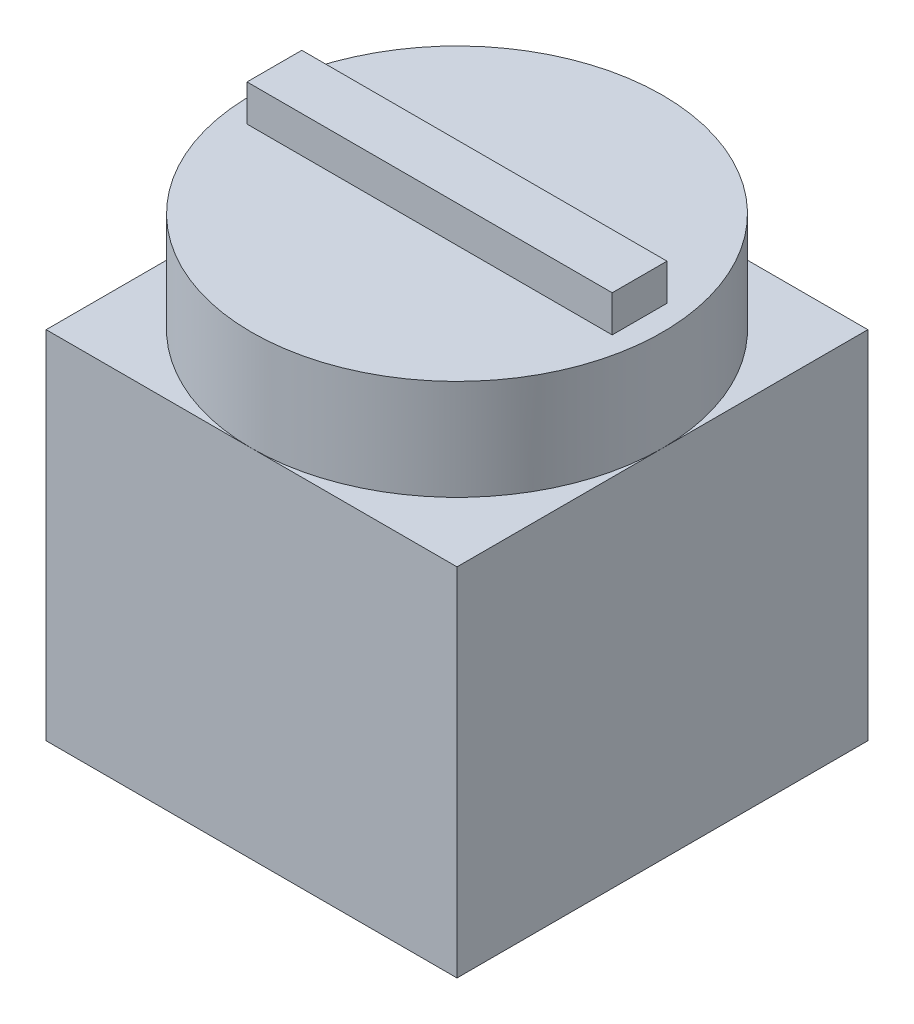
ISO-10303-21;
HEADER;
FILE_DESCRIPTION(('STEP AP214'),'2;1');
FILE_NAME('part.step','',(''),(''),'','','');
FILE_SCHEMA(('AUTOMOTIVE_DESIGN { 1 0 10303 214 1 1 1 1 }'));
ENDSEC;
DATA;
#1=APPLICATION_CONTEXT('core data for automotive mechanical design processes');
#2=APPLICATION_PROTOCOL_DEFINITION('international standard','automotive_design',2000,#1);
#3=PRODUCT_CONTEXT('',#1,'mechanical');
#4=PRODUCT('Part','Part','',(#3));
#5=PRODUCT_RELATED_PRODUCT_CATEGORY('part','',(#4));
#6=PRODUCT_DEFINITION_FORMATION('','',#4);
#7=PRODUCT_DEFINITION_CONTEXT('part definition',#1,'design');
#8=PRODUCT_DEFINITION('design','',#6,#7);
#9=PRODUCT_DEFINITION_SHAPE('','',#8);
#10=(LENGTH_UNIT() NAMED_UNIT(*) SI_UNIT(.MILLI.,.METRE.));
#11=(NAMED_UNIT(*) PLANE_ANGLE_UNIT() SI_UNIT($,.RADIAN.));
#12=(NAMED_UNIT(*) SI_UNIT($,.STERADIAN.) SOLID_ANGLE_UNIT());
#13=UNCERTAINTY_MEASURE_WITH_UNIT(LENGTH_MEASURE(1.E-05),#10,'distance_accuracy_value','');
#14=(GEOMETRIC_REPRESENTATION_CONTEXT(3) GLOBAL_UNCERTAINTY_ASSIGNED_CONTEXT((#13)) GLOBAL_UNIT_ASSIGNED_CONTEXT((#10,
#11,#12)) REPRESENTATION_CONTEXT('',''));
#15=CARTESIAN_POINT('',(0.,0.,0.));
#16=DIRECTION('',(0.,0.,1.));
#17=DIRECTION('',(1.,0.,0.));
#18=AXIS2_PLACEMENT_3D('',#15,#16,#17);
#19=CARTESIAN_POINT('',(0.,7.8,0.));
#20=DIRECTION('',(0.,1.,0.));
#21=DIRECTION('',(0.,0.,1.));
#22=AXIS2_PLACEMENT_3D('',#19,#20,#21);
#23=PLANE('',#22);
#24=CARTESIAN_POINT('',(0.,7.8,0.));
#25=DIRECTION('',(0.,1.,0.));
#26=DIRECTION('',(0.,0.,1.));
#27=AXIS2_PLACEMENT_3D('',#24,#25,#26);
#28=CIRCLE('',#27,4.5);
#29=CARTESIAN_POINT('',(0.,7.8,4.5));
#30=VERTEX_POINT('',#29);
#31=CARTESIAN_POINT('',(4.5,7.8,0.));
#32=VERTEX_POINT('',#31);
#33=EDGE_CURVE('E48',#30,#32,#28,.T.);
#34=ORIENTED_EDGE('',*,*,#33,.F.);
#35=DIRECTION('',(1.,0.,0.));
#36=VECTOR('',#35,1.);
#37=CARTESIAN_POINT('',(-4.5,7.8,4.5));
#38=LINE('',#37,#36);
#39=CARTESIAN_POINT('',(4.5,7.8,4.5));
#40=VERTEX_POINT('',#39);
#41=EDGE_CURVE('E161',#30,#40,#38,.T.);
#42=ORIENTED_EDGE('',*,*,#41,.T.);
#43=DIRECTION('',(0.,0.,-1.));
#44=VECTOR('',#43,1.);
#45=CARTESIAN_POINT('',(4.5,7.8,-4.5));
#46=LINE('',#45,#44);
#47=EDGE_CURVE('E149',#40,#32,#46,.T.);
#48=ORIENTED_EDGE('',*,*,#47,.T.);
#49=EDGE_LOOP('',(#34,#42,#48));
#50=FACE_BOUND('',#49,.T.);
#51=ADVANCED_FACE('F37',(#50),#23,.T.);
#52=CARTESIAN_POINT('',(0.,7.8,-4.5));
#53=VERTEX_POINT('',#52);
#54=EDGE_CURVE('E11',#32,#53,#28,.T.);
#55=ORIENTED_EDGE('',*,*,#54,.F.);
#56=CARTESIAN_POINT('',(4.5,7.8,-4.5));
#57=VERTEX_POINT('',#56);
#58=EDGE_CURVE('E153',#32,#57,#46,.T.);
#59=ORIENTED_EDGE('',*,*,#58,.T.);
#60=DIRECTION('',(-1.,0.,0.));
#61=VECTOR('',#60,1.);
#62=CARTESIAN_POINT('',(-4.5,7.8,-4.5));
#63=LINE('',#62,#61);
#64=EDGE_CURVE('E154',#57,#53,#63,.T.);
#65=ORIENTED_EDGE('',*,*,#64,.T.);
#66=EDGE_LOOP('',(#55,#59,#65));
#67=FACE_BOUND('',#66,.T.);
#68=ADVANCED_FACE('F196',(#67),#23,.T.);
#69=CARTESIAN_POINT('',(-4.5,7.8,0.));
#70=VERTEX_POINT('',#69);
#71=EDGE_CURVE('E46',#53,#70,#28,.T.);
#72=ORIENTED_EDGE('',*,*,#71,.F.);
#73=CARTESIAN_POINT('',(-4.5,7.8,-4.5));
#74=VERTEX_POINT('',#73);
#75=EDGE_CURVE('E152',#53,#74,#63,.T.);
#76=ORIENTED_EDGE('',*,*,#75,.T.);
#77=DIRECTION('',(0.,0.,1.));
#78=VECTOR('',#77,1.);
#79=CARTESIAN_POINT('',(-4.5,7.8,-4.5));
#80=LINE('',#79,#78);
#81=EDGE_CURVE('E158',#74,#70,#80,.T.);
#82=ORIENTED_EDGE('',*,*,#81,.T.);
#83=EDGE_LOOP('',(#72,#76,#82));
#84=FACE_BOUND('',#83,.T.);
#85=ADVANCED_FACE('F193',(#84),#23,.T.);
#86=CARTESIAN_POINT('',(4.5,7.8,-4.5));
#87=DIRECTION('',(-1.,0.,0.));
#88=DIRECTION('',(0.,0.,1.));
#89=AXIS2_PLACEMENT_3D('',#86,#87,#88);
#90=PLANE('',#89);
#91=DIRECTION('',(0.,0.,-1.));
#92=VECTOR('',#91,1.);
#93=CARTESIAN_POINT('',(4.5,0.,-4.5));
#94=LINE('',#93,#92);
#95=CARTESIAN_POINT('',(4.5,0.,4.5));
#96=VERTEX_POINT('',#95);
#97=CARTESIAN_POINT('',(4.5,0.,-4.5));
#98=VERTEX_POINT('',#97);
#99=EDGE_CURVE('E147',#96,#98,#94,.T.);
#100=ORIENTED_EDGE('',*,*,#99,.T.);
#101=DIRECTION('',(0.,-1.,0.));
#102=VECTOR('',#101,1.);
#103=CARTESIAN_POINT('',(4.5,7.8,-4.5));
#104=LINE('',#103,#102);
#105=EDGE_CURVE('E41',#57,#98,#104,.T.);
#106=ORIENTED_EDGE('',*,*,#105,.F.);
#107=ORIENTED_EDGE('',*,*,#58,.F.);
#108=ORIENTED_EDGE('',*,*,#47,.F.);
#109=DIRECTION('',(0.,-1.,0.));
#110=VECTOR('',#109,1.);
#111=CARTESIAN_POINT('',(4.5,7.8,4.5));
#112=LINE('',#111,#110);
#113=EDGE_CURVE('E164',#40,#96,#112,.T.);
#114=ORIENTED_EDGE('',*,*,#113,.T.);
#115=EDGE_LOOP('',(#100,#106,#107,#108,#114));
#116=FACE_BOUND('',#115,.T.);
#117=ADVANCED_FACE('F39',(#116),#90,.F.);
#118=CARTESIAN_POINT('',(-4.5,7.8,-4.5));
#119=DIRECTION('',(0.,0.,1.));
#120=DIRECTION('',(1.,0.,0.));
#121=AXIS2_PLACEMENT_3D('',#118,#119,#120);
#122=PLANE('',#121);
#123=DIRECTION('',(-1.,0.,0.));
#124=VECTOR('',#123,1.);
#125=CARTESIAN_POINT('',(-4.5,0.,-4.5));
#126=LINE('',#125,#124);
#127=CARTESIAN_POINT('',(-4.5,0.,-4.5));
#128=VERTEX_POINT('',#127);
#129=EDGE_CURVE('E167',#98,#128,#126,.T.);
#130=ORIENTED_EDGE('',*,*,#129,.T.);
#131=DIRECTION('',(0.,-1.,0.));
#132=VECTOR('',#131,1.);
#133=CARTESIAN_POINT('',(-4.5,7.8,-4.5));
#134=LINE('',#133,#132);
#135=EDGE_CURVE('E177',#74,#128,#134,.T.);
#136=ORIENTED_EDGE('',*,*,#135,.F.);
#137=ORIENTED_EDGE('',*,*,#75,.F.);
#138=ORIENTED_EDGE('',*,*,#64,.F.);
#139=ORIENTED_EDGE('',*,*,#105,.T.);
#140=EDGE_LOOP('',(#130,#136,#137,#138,#139));
#141=FACE_BOUND('',#140,.T.);
#142=ADVANCED_FACE('F194',(#141),#122,.F.);
#143=CARTESIAN_POINT('',(-4.5,7.8,-4.5));
#144=DIRECTION('',(1.,0.,0.));
#145=DIRECTION('',(0.,0.,-1.));
#146=AXIS2_PLACEMENT_3D('',#143,#144,#145);
#147=PLANE('',#146);
#148=DIRECTION('',(0.,0.,1.));
#149=VECTOR('',#148,1.);
#150=CARTESIAN_POINT('',(-4.5,0.,-4.5));
#151=LINE('',#150,#149);
#152=CARTESIAN_POINT('',(-4.5,0.,4.5));
#153=VERTEX_POINT('',#152);
#154=EDGE_CURVE('E169',#128,#153,#151,.T.);
#155=ORIENTED_EDGE('',*,*,#154,.T.);
#156=DIRECTION('',(0.,-1.,0.));
#157=VECTOR('',#156,1.);
#158=CARTESIAN_POINT('',(-4.5,7.8,4.5));
#159=LINE('',#158,#157);
#160=CARTESIAN_POINT('',(-4.5,7.8,4.5));
#161=VERTEX_POINT('',#160);
#162=EDGE_CURVE('E175',#161,#153,#159,.T.);
#163=ORIENTED_EDGE('',*,*,#162,.F.);
#164=EDGE_CURVE('E157',#70,#161,#80,.T.);
#165=ORIENTED_EDGE('',*,*,#164,.F.);
#166=ORIENTED_EDGE('',*,*,#81,.F.);
#167=ORIENTED_EDGE('',*,*,#135,.T.);
#168=EDGE_LOOP('',(#155,#163,#165,#166,#167));
#169=FACE_BOUND('',#168,.T.);
#170=ADVANCED_FACE('F212',(#169),#147,.F.);
#171=CARTESIAN_POINT('',(-4.5,7.8,4.5));
#172=DIRECTION('',(0.,0.,-1.));
#173=DIRECTION('',(-1.,0.,0.));
#174=AXIS2_PLACEMENT_3D('',#171,#172,#173);
#175=PLANE('',#174);
#176=DIRECTION('',(1.,0.,0.));
#177=VECTOR('',#176,1.);
#178=CARTESIAN_POINT('',(-4.5,0.,4.5));
#179=LINE('',#178,#177);
#180=EDGE_CURVE('E171',#153,#96,#179,.T.);
#181=ORIENTED_EDGE('',*,*,#180,.T.);
#182=ORIENTED_EDGE('',*,*,#113,.F.);
#183=ORIENTED_EDGE('',*,*,#41,.F.);
#184=EDGE_CURVE('E162',#161,#30,#38,.T.);
#185=ORIENTED_EDGE('',*,*,#184,.F.);
#186=ORIENTED_EDGE('',*,*,#162,.T.);
#187=EDGE_LOOP('',(#181,#182,#183,#185,#186));
#188=FACE_BOUND('',#187,.T.);
#189=ADVANCED_FACE('F206',(#188),#175,.F.);
#190=EDGE_CURVE('E141',#70,#30,#28,.T.);
#191=ORIENTED_EDGE('',*,*,#190,.F.);
#192=ORIENTED_EDGE('',*,*,#164,.T.);
#193=ORIENTED_EDGE('',*,*,#184,.T.);
#194=EDGE_LOOP('',(#191,#192,#193));
#195=FACE_BOUND('',#194,.T.);
#196=ADVANCED_FACE('F215',(#195),#23,.T.);
#197=CARTESIAN_POINT('',(0.,0.,0.));
#198=DIRECTION('',(0.,1.,0.));
#199=DIRECTION('',(0.,0.,1.));
#200=AXIS2_PLACEMENT_3D('',#197,#198,#199);
#201=PLANE('',#200);
#202=ORIENTED_EDGE('',*,*,#99,.F.);
#203=ORIENTED_EDGE('',*,*,#180,.F.);
#204=ORIENTED_EDGE('',*,*,#154,.F.);
#205=ORIENTED_EDGE('',*,*,#129,.F.);
#206=EDGE_LOOP('',(#202,#203,#204,#205));
#207=FACE_BOUND('',#206,.T.);
#208=ADVANCED_FACE('F210',(#207),#201,.F.);
#209=CARTESIAN_POINT('',(0.,10.,0.));
#210=DIRECTION('',(0.,-1.,0.));
#211=DIRECTION('',(0.,0.,-1.));
#212=AXIS2_PLACEMENT_3D('',#209,#210,#211);
#213=CYLINDRICAL_SURFACE('',#212,4.5);
#214=CARTESIAN_POINT('',(0.,10.,0.));
#215=DIRECTION('',(0.,1.,0.));
#216=DIRECTION('',(0.,0.,1.));
#217=AXIS2_PLACEMENT_3D('',#214,#215,#216);
#218=CIRCLE('',#217,4.5);
#219=CARTESIAN_POINT('',(0.,10.,4.5));
#220=VERTEX_POINT('',#219);
#221=EDGE_CURVE('E140',#220,#220,#218,.T.);
#222=ORIENTED_EDGE('',*,*,#221,.F.);
#223=EDGE_LOOP('',(#222));
#224=FACE_BOUND('',#223,.T.);
#225=ORIENTED_EDGE('',*,*,#33,.T.);
#226=ORIENTED_EDGE('',*,*,#54,.T.);
#227=ORIENTED_EDGE('',*,*,#71,.T.);
#228=ORIENTED_EDGE('',*,*,#190,.T.);
#229=EDGE_LOOP('',(#225,#226,#227,#228));
#230=FACE_BOUND('',#229,.T.);
#231=ADVANCED_FACE('F190',(#224,#230),#213,.T.);
#232=CARTESIAN_POINT('',(0.,10.,0.));
#233=DIRECTION('',(0.,1.,0.));
#234=DIRECTION('',(0.,0.,1.));
#235=AXIS2_PLACEMENT_3D('',#232,#233,#234);
#236=PLANE('',#235);
#237=DIRECTION('',(0.,0.,1.));
#238=VECTOR('',#237,1.);
#239=CARTESIAN_POINT('',(-4.,10.,0.));
#240=LINE('',#239,#238);
#241=CARTESIAN_POINT('',(-4.,10.,-0.6));
#242=VERTEX_POINT('',#241);
#243=CARTESIAN_POINT('',(-4.,10.,0.6));
#244=VERTEX_POINT('',#243);
#245=EDGE_CURVE('E55',#242,#244,#240,.T.);
#246=ORIENTED_EDGE('',*,*,#245,.F.);
#247=DIRECTION('',(1.,0.,0.));
#248=VECTOR('',#247,1.);
#249=CARTESIAN_POINT('',(0.,10.,-0.6));
#250=LINE('',#249,#248);
#251=CARTESIAN_POINT('',(4.,10.,-0.6));
#252=VERTEX_POINT('',#251);
#253=EDGE_CURVE('E60',#242,#252,#250,.T.);
#254=ORIENTED_EDGE('',*,*,#253,.T.);
#255=DIRECTION('',(0.,0.,1.));
#256=VECTOR('',#255,1.);
#257=CARTESIAN_POINT('',(4.,10.,0.));
#258=LINE('',#257,#256);
#259=CARTESIAN_POINT('',(4.,10.,0.6));
#260=VERTEX_POINT('',#259);
#261=EDGE_CURVE('E318',#252,#260,#258,.T.);
#262=ORIENTED_EDGE('',*,*,#261,.T.);
#263=DIRECTION('',(1.,0.,0.));
#264=VECTOR('',#263,1.);
#265=CARTESIAN_POINT('',(0.,10.,0.6));
#266=LINE('',#265,#264);
#267=EDGE_CURVE('E320',#244,#260,#266,.T.);
#268=ORIENTED_EDGE('',*,*,#267,.F.);
#269=EDGE_LOOP('',(#246,#254,#262,#268));
#270=FACE_BOUND('',#269,.T.);
#271=ORIENTED_EDGE('',*,*,#221,.T.);
#272=EDGE_LOOP('',(#271));
#273=FACE_BOUND('',#272,.T.);
#274=ADVANCED_FACE('F254',(#270,#273),#236,.T.);
#275=CARTESIAN_POINT('',(-4.,10.8,0.));
#276=DIRECTION('',(1.,0.,0.));
#277=DIRECTION('',(0.,0.,-1.));
#278=AXIS2_PLACEMENT_3D('',#275,#276,#277);
#279=PLANE('',#278);
#280=ORIENTED_EDGE('',*,*,#245,.T.);
#281=DIRECTION('',(0.,-1.,0.));
#282=VECTOR('',#281,1.);
#283=CARTESIAN_POINT('',(-4.,10.8,0.6));
#284=LINE('',#283,#282);
#285=CARTESIAN_POINT('',(-4.,10.8,0.6));
#286=VERTEX_POINT('',#285);
#287=EDGE_CURVE('E121',#286,#244,#284,.T.);
#288=ORIENTED_EDGE('',*,*,#287,.F.);
#289=DIRECTION('',(0.,0.,1.));
#290=VECTOR('',#289,1.);
#291=CARTESIAN_POINT('',(-4.,10.8,0.));
#292=LINE('',#291,#290);
#293=CARTESIAN_POINT('',(-4.,10.8,-0.6));
#294=VERTEX_POINT('',#293);
#295=EDGE_CURVE('E128',#294,#286,#292,.T.);
#296=ORIENTED_EDGE('',*,*,#295,.F.);
#297=DIRECTION('',(0.,-1.,0.));
#298=VECTOR('',#297,1.);
#299=CARTESIAN_POINT('',(-4.,10.8,-0.6));
#300=LINE('',#299,#298);
#301=EDGE_CURVE('E316',#294,#242,#300,.T.);
#302=ORIENTED_EDGE('',*,*,#301,.T.);
#303=EDGE_LOOP('',(#280,#288,#296,#302));
#304=FACE_BOUND('',#303,.T.);
#305=ADVANCED_FACE('F137',(#304),#279,.F.);
#306=CARTESIAN_POINT('',(0.,10.8,0.6));
#307=DIRECTION('',(0.,0.,-1.));
#308=DIRECTION('',(-1.,0.,0.));
#309=AXIS2_PLACEMENT_3D('',#306,#307,#308);
#310=PLANE('',#309);
#311=ORIENTED_EDGE('',*,*,#267,.T.);
#312=DIRECTION('',(0.,-1.,0.));
#313=VECTOR('',#312,1.);
#314=CARTESIAN_POINT('',(4.,10.8,0.6));
#315=LINE('',#314,#313);
#316=CARTESIAN_POINT('',(4.,10.8,0.6));
#317=VERTEX_POINT('',#316);
#318=EDGE_CURVE('E123',#317,#260,#315,.T.);
#319=ORIENTED_EDGE('',*,*,#318,.F.);
#320=DIRECTION('',(1.,0.,0.));
#321=VECTOR('',#320,1.);
#322=CARTESIAN_POINT('',(0.,10.8,0.6));
#323=LINE('',#322,#321);
#324=EDGE_CURVE('E116',#286,#317,#323,.T.);
#325=ORIENTED_EDGE('',*,*,#324,.F.);
#326=ORIENTED_EDGE('',*,*,#287,.T.);
#327=EDGE_LOOP('',(#311,#319,#325,#326));
#328=FACE_BOUND('',#327,.T.);
#329=ADVANCED_FACE('F119',(#328),#310,.F.);
#330=CARTESIAN_POINT('',(4.,10.8,0.));
#331=DIRECTION('',(1.,0.,0.));
#332=DIRECTION('',(0.,0.,-1.));
#333=AXIS2_PLACEMENT_3D('',#330,#331,#332);
#334=PLANE('',#333);
#335=ORIENTED_EDGE('',*,*,#261,.F.);
#336=DIRECTION('',(0.,-1.,0.));
#337=VECTOR('',#336,1.);
#338=CARTESIAN_POINT('',(4.,10.8,-0.6));
#339=LINE('',#338,#337);
#340=CARTESIAN_POINT('',(4.,10.8,-0.6));
#341=VERTEX_POINT('',#340);
#342=EDGE_CURVE('E142',#341,#252,#339,.T.);
#343=ORIENTED_EDGE('',*,*,#342,.F.);
#344=DIRECTION('',(0.,0.,1.));
#345=VECTOR('',#344,1.);
#346=CARTESIAN_POINT('',(4.,10.8,0.));
#347=LINE('',#346,#345);
#348=EDGE_CURVE('E127',#341,#317,#347,.T.);
#349=ORIENTED_EDGE('',*,*,#348,.T.);
#350=ORIENTED_EDGE('',*,*,#318,.T.);
#351=EDGE_LOOP('',(#335,#343,#349,#350));
#352=FACE_BOUND('',#351,.T.);
#353=ADVANCED_FACE('F272',(#352),#334,.T.);
#354=CARTESIAN_POINT('',(0.,10.8,-0.6));
#355=DIRECTION('',(0.,0.,-1.));
#356=DIRECTION('',(-1.,0.,0.));
#357=AXIS2_PLACEMENT_3D('',#354,#355,#356);
#358=PLANE('',#357);
#359=ORIENTED_EDGE('',*,*,#253,.F.);
#360=ORIENTED_EDGE('',*,*,#301,.F.);
#361=DIRECTION('',(1.,0.,0.));
#362=VECTOR('',#361,1.);
#363=CARTESIAN_POINT('',(0.,10.8,-0.6));
#364=LINE('',#363,#362);
#365=EDGE_CURVE('E134',#294,#341,#364,.T.);
#366=ORIENTED_EDGE('',*,*,#365,.T.);
#367=ORIENTED_EDGE('',*,*,#342,.T.);
#368=EDGE_LOOP('',(#359,#360,#366,#367));
#369=FACE_BOUND('',#368,.T.);
#370=ADVANCED_FACE('F279',(#369),#358,.T.);
#371=CARTESIAN_POINT('',(0.,10.8,0.));
#372=DIRECTION('',(0.,1.,0.));
#373=DIRECTION('',(0.,0.,1.));
#374=AXIS2_PLACEMENT_3D('',#371,#372,#373);
#375=PLANE('',#374);
#376=ORIENTED_EDGE('',*,*,#295,.T.);
#377=ORIENTED_EDGE('',*,*,#324,.T.);
#378=ORIENTED_EDGE('',*,*,#348,.F.);
#379=ORIENTED_EDGE('',*,*,#365,.F.);
#380=EDGE_LOOP('',(#376,#377,#378,#379));
#381=FACE_BOUND('',#380,.T.);
#382=ADVANCED_FACE('F132',(#381),#375,.T.);
#383=CLOSED_SHELL('',(#51,#68,#85,#117,#142,#170,#189,#196,#208,#231,#274,#305,#329,#353,#370,#382));
#384=MANIFOLD_SOLID_BREP('B2',#383);
#385=ADVANCED_BREP_SHAPE_REPRESENTATION('',(#18,#384),#14);
#386=SHAPE_DEFINITION_REPRESENTATION(#9,#385);
ENDSEC;
END-ISO-10303-21;
